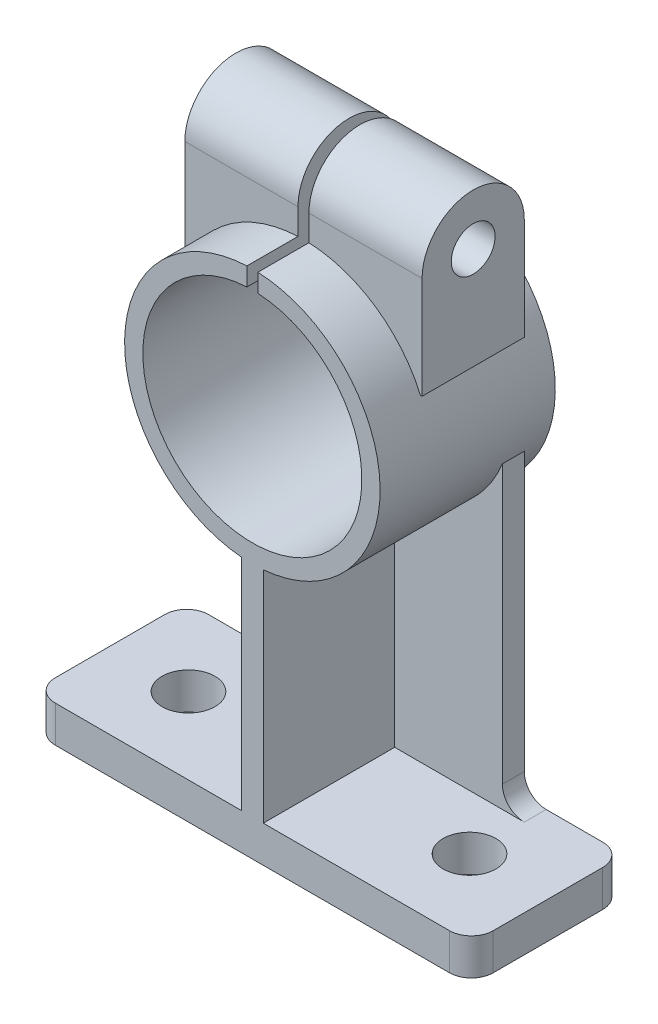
from build123d import *

# Parameters (mm, degrees)
CROQUIS2_W              = 120
CROQUIS2_H              = 42
SALIENTE_EXTRUIR1_DEPTH = 10
REDONDEO1_R             = 6
CROQUIS3_W              = 65
CROQUIS3_H              = 95
SALIENTE_EXTRUIR2_DEPTH = 6
REDONDEO2_R             = 6
CROQUIS4_R              = 7.240565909
CORTAR_EXTRUIR1_DEPTH   = 120.95415791
CROQUIS6_R              = 35
CROQUIS6_R_2            = 30
EXTRUIR_L_MINA1_DEPTH   = 48
CROQUIS8_W              = 6
CROQUIS8_H              = 60.128808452
SALIENTE_EXTRUIR3_DEPTH = 36
CROQUIS9_R              = 6
SALIENTE_EXTRUIR4_DEPTH = 32.5
CROQUIS10_R             = 30
CORTAR_EXTRUIR3_DEPTH   = 179.395627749
CROQUIS11_W             = 3
CROQUIS11_H             = 67.611732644
CORTAR_EXTRUIR4_DEPTH   = 179.395627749


with BuildPart() as part:
    # Croquis2 → Saliente-Extruir1 (new body)
    with BuildSketch(Plane(origin=(0, 0, 0), x_dir=(1, 0, 0), z_dir=(0, 1, 0))):
        with Locations((0, -21)):
            Rectangle(CROQUIS2_W, CROQUIS2_H)
    extrude(amount=SALIENTE_EXTRUIR1_DEPTH)

    # Redondeo1
    redondeo1_edges = [part.edges().sort_by_distance(p)[0] for p in [
        (60, 5, 42),
        (-60, 5, 42),
        (-60, 5, 0),
        (60, 5, 0),
    ]]
    fillet(redondeo1_edges, radius=REDONDEO1_R)

    # Croquis3 → Saliente-Extruir2 (add)
    with BuildSketch(Plane.XY):
        with Locations((0, 57.5)):
            Rectangle(CROQUIS3_W, CROQUIS3_H)
    extrude(amount=SALIENTE_EXTRUIR2_DEPTH)

    # Redondeo2
    redondeo2_edges = [part.edges().sort_by_distance(p)[0] for p in [
        (32.5, 10, 3),
        (-32.5, 10, 3),
    ]]
    fillet(redondeo2_edges, radius=REDONDEO2_R)

    # Croquis4 → Cortar-Extruir1 (cut, through all)
    with BuildSketch(Plane(origin=(0, 10, 0), x_dir=(1, 0, 0), z_dir=(0, 1, 0))):
        with Locations(Location((-38.5, -21, 0), (0, 0, 270))):
            Circle(CROQUIS4_R)
    cortar_extruir1 = extrude(amount=-CORTAR_EXTRUIR1_DEPTH, mode=Mode.SUBTRACT)

    # Simetr_a1: Cortar-Extruir1 across plane
    add(cortar_extruir1.mirror(Plane(origin=(0, 0, 0), x_dir=(0, 0, 1), z_dir=(1, 0, 0))), mode=Mode.SUBTRACT)

    # Croquis6 → Extruir-L_mina1 (add)
    with BuildSketch(Plane.XY.offset(-6)):
        with Locations((0, 105)):
            Circle(CROQUIS6_R)
        with Locations((0, 105)):
            Circle(CROQUIS6_R_2, mode=Mode.SUBTRACT)
    extrude(amount=EXTRUIR_L_MINA1_DEPTH)

    # Croquis8 → Saliente-Extruir3 (add)
    with BuildSketch(Plane.XY.offset(6)):
        with Locations((0, 40.064404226)):
            Rectangle(CROQUIS8_W, CROQUIS8_H)
    extrude(amount=SALIENTE_EXTRUIR3_DEPTH)

    # Croquis9 → Saliente-Extruir4 (add, symmetric)
    with BuildSketch(Plane(origin=(0, 0, 0), x_dir=(0, 0, -1), z_dir=(1, 0, 0))):
        with BuildLine():
            Line((0, 126.068220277), (0, 147))
            ThreePointArc((0, 147), (-14, 161), (-28, 147))
            Line((-28, 147), (-28, 119.03405794))
            Line((-28, 119.03405794), (0, 119.03405794))
            Line((0, 119.03405794), (0, 126.068220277))
        make_face()
        with Locations((-14, 147)):
            Circle(CROQUIS9_R, mode=Mode.SUBTRACT)
    extrude(amount=SALIENTE_EXTRUIR4_DEPTH, both=True)

    # Croquis10 → Cortar-Extruir3 (cut, through all)
    with BuildSketch(Plane.XY.offset(-6)):
        with Locations((0, 105)):
            Circle(CROQUIS10_R)
    extrude(amount=CORTAR_EXTRUIR3_DEPTH, mode=Mode.SUBTRACT)

    # Croquis11 → Cortar-Extruir4 (cut, through all)
    with BuildSketch(Plane.XY.offset(-6)):
        with Locations((0, 138.805866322)):
            Rectangle(CROQUIS11_W, CROQUIS11_H)
    extrude(amount=CORTAR_EXTRUIR4_DEPTH, mode=Mode.SUBTRACT)


solid = part.part
